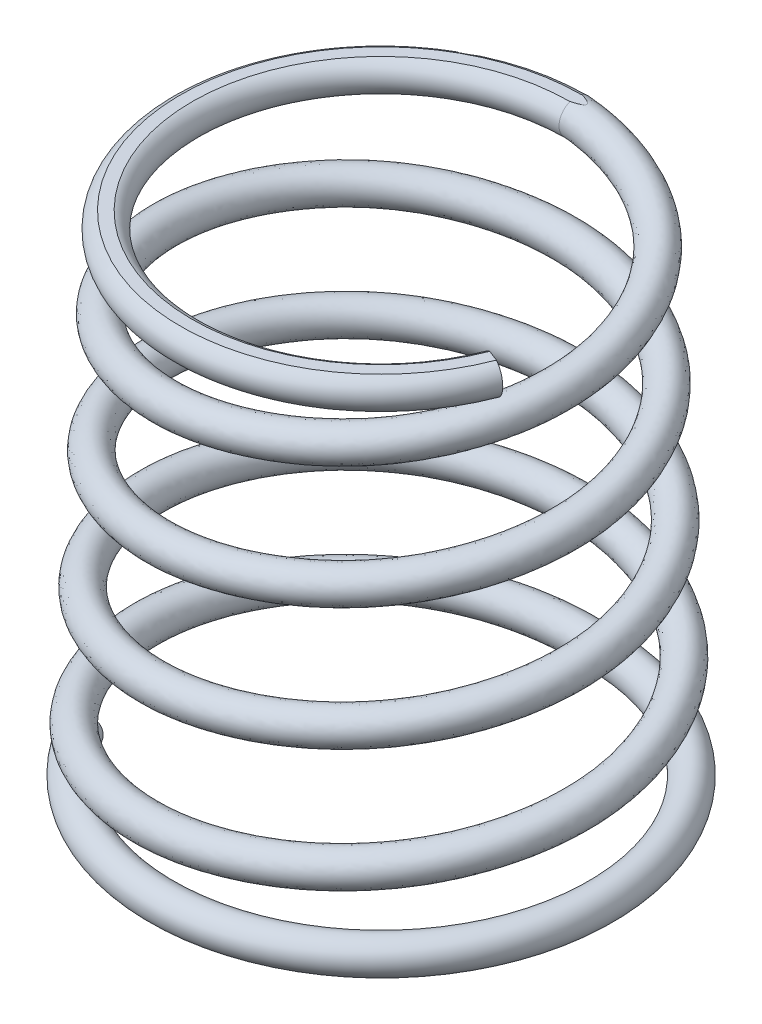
ISO-10303-21;
HEADER;
FILE_DESCRIPTION(('STEP AP214'),'2;1');
FILE_NAME('part.step','',(''),(''),'','','');
FILE_SCHEMA(('AUTOMOTIVE_DESIGN { 1 0 10303 214 1 1 1 1 }'));
ENDSEC;
DATA;
#1=APPLICATION_CONTEXT('core data for automotive mechanical design processes');
#2=APPLICATION_PROTOCOL_DEFINITION('international standard','automotive_design',2000,#1);
#3=PRODUCT_CONTEXT('',#1,'mechanical');
#4=PRODUCT('Part','Part','',(#3));
#5=PRODUCT_RELATED_PRODUCT_CATEGORY('part','',(#4));
#6=PRODUCT_DEFINITION_FORMATION('','',#4);
#7=PRODUCT_DEFINITION_CONTEXT('part definition',#1,'design');
#8=PRODUCT_DEFINITION('design','',#6,#7);
#9=PRODUCT_DEFINITION_SHAPE('','',#8);
#10=(LENGTH_UNIT() NAMED_UNIT(*) SI_UNIT(.MILLI.,.METRE.));
#11=(NAMED_UNIT(*) PLANE_ANGLE_UNIT() SI_UNIT($,.RADIAN.));
#12=(NAMED_UNIT(*) SI_UNIT($,.STERADIAN.) SOLID_ANGLE_UNIT());
#13=UNCERTAINTY_MEASURE_WITH_UNIT(LENGTH_MEASURE(1.E-05),#10,'distance_accuracy_value','');
#14=(GEOMETRIC_REPRESENTATION_CONTEXT(3) GLOBAL_UNCERTAINTY_ASSIGNED_CONTEXT((#13)) GLOBAL_UNIT_ASSIGNED_CONTEXT((#10,
#11,#12)) REPRESENTATION_CONTEXT('',''));
#15=CARTESIAN_POINT('',(0.,0.,0.));
#16=DIRECTION('',(0.,0.,1.));
#17=DIRECTION('',(1.,0.,0.));
#18=AXIS2_PLACEMENT_3D('',#15,#16,#17);
#19=CARTESIAN_POINT('',(-3.17002898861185E-13,14.,-5.76629109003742));
#20=DIRECTION('',(1.,0.,0.));
#21=DIRECTION('',(0.,0.,-1.));
#22=AXIS2_PLACEMENT_3D('',#19,#20,#21);
#23=PLANE('',#22);
#24=CARTESIAN_POINT('',(-3.21832305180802E-13,14.,-5.76102389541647));
#25=DIRECTION('',(-1.,0.,0.));
#26=DIRECTION('',(0.,0.,1.));
#27=AXIS2_PLACEMENT_3D('',#24,#25,#26);
#28=CIRCLE('',#27,0.500000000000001);
#29=CARTESIAN_POINT('',(-3.31547664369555E-13,14.4687800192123,-5.93493563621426));
#30=VERTEX_POINT('',#29);
#31=CARTESIAN_POINT('',(-3.16855776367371E-13,13.5000069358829,-5.76365749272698));
#32=VERTEX_POINT('',#31);
#33=EDGE_CURVE('E90',#30,#32,#28,.T.);
#34=ORIENTED_EDGE('',*,*,#33,.F.);
#35=DIRECTION('',(0.,0.,-1.));
#36=VECTOR('',#35,1.);
#37=CARTESIAN_POINT('',(-3.17002898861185E-13,14.4687800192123,-5.76629109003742));
#38=LINE('',#37,#36);
#39=CARTESIAN_POINT('',(-3.26718252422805E-13,14.4687800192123,-5.94020283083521));
#40=VERTEX_POINT('',#39);
#41=EDGE_CURVE('E95',#30,#40,#38,.T.);
#42=ORIENTED_EDGE('',*,*,#41,.T.);
#43=CARTESIAN_POINT('',(-3.17002898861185E-13,14.,-5.76629109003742));
#44=DIRECTION('',(1.,0.,0.));
#45=DIRECTION('',(0.,0.,-1.));
#46=AXIS2_PLACEMENT_3D('',#43,#44,#45);
#47=CIRCLE('',#46,0.500000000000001);
#48=CARTESIAN_POINT('',(-3.4493474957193E-13,14.,-6.26629109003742));
#49=VERTEX_POINT('',#48);
#50=EDGE_CURVE('E41',#49,#40,#47,.T.);
#51=ORIENTED_EDGE('',*,*,#50,.F.);
#52=EDGE_CURVE('E153',#32,#49,#47,.T.);
#53=ORIENTED_EDGE('',*,*,#52,.F.);
#54=EDGE_LOOP('',(#34,#42,#51,#53));
#55=FACE_BOUND('',#54,.T.);
#56=ADVANCED_FACE('F31',(#55),#23,.F.);
#57=CARTESIAN_POINT('',(0.,0.,-6.5));
#58=DIRECTION('',(1.,0.,0.));
#59=DIRECTION('',(0.,0.,-1.));
#60=AXIS2_PLACEMENT_3D('',#57,#58,#59);
#61=PLANE('',#60);
#62=CARTESIAN_POINT('',(0.,0.,-6.5));
#63=DIRECTION('',(1.,0.,0.));
#64=DIRECTION('',(0.,0.,-1.));
#65=AXIS2_PLACEMENT_3D('',#62,#63,#64);
#66=CIRCLE('',#65,0.500000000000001);
#67=CARTESIAN_POINT('',(0.,0.,-7.));
#68=VERTEX_POINT('',#67);
#69=CARTESIAN_POINT('',(0.,0.499993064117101,-6.49736640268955));
#70=VERTEX_POINT('',#69);
#71=EDGE_CURVE('E150',#68,#70,#66,.T.);
#72=ORIENTED_EDGE('',*,*,#71,.T.);
#73=CARTESIAN_POINT('',(0.,0.,-6.49473280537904));
#74=DIRECTION('',(1.,0.,0.));
#75=DIRECTION('',(0.,0.,-1.));
#76=AXIS2_PLACEMENT_3D('',#73,#74,#75);
#77=CIRCLE('',#76,0.500000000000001);
#78=CARTESIAN_POINT('',(0.,-0.4999930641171,-6.49736640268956));
#79=VERTEX_POINT('',#78);
#80=EDGE_CURVE('E89',#79,#70,#77,.T.);
#81=ORIENTED_EDGE('',*,*,#80,.F.);
#82=EDGE_CURVE('E147',#79,#68,#66,.T.);
#83=ORIENTED_EDGE('',*,*,#82,.T.);
#84=EDGE_LOOP('',(#72,#81,#83));
#85=FACE_BOUND('',#84,.T.);
#86=ADVANCED_FACE('F33',(#85),#61,.T.);
#87=CARTESIAN_POINT('',(0.,0.,-7.));
#88=CARTESIAN_POINT('',(-1.83259572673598,0.145833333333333,-6.99235719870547));
#89=CARTESIAN_POINT('',(-3.64734257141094,0.291666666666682,-6.23053525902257));
#90=CARTESIAN_POINT('',(-6.21972670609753,0.583333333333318,-3.63653401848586));
#91=CARTESIAN_POINT('',(-6.96178599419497,0.729166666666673,-1.82059042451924));
#92=CARTESIAN_POINT('',(-6.94650039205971,1.02083333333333,1.82059042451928));
#93=CARTESIAN_POINT('',(-6.1896205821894,1.16666666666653,3.62340593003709));
#94=CARTESIAN_POINT('',(-3.61259737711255,1.45833333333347,6.17881202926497));
#95=CARTESIAN_POINT('',(-1.80858514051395,1.60416666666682,6.9159291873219));
#96=CARTESIAN_POINT('',(1.80858514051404,1.89583333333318,6.90064358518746));
#97=CARTESIAN_POINT('',(3.5994692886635,2.04166666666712,6.14870590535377));
#98=CARTESIAN_POINT('',(6.13789735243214,2.33333333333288,3.58866073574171));
#99=CARTESIAN_POINT('',(6.87007238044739,2.47916666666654,1.79657985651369));
#100=CARTESIAN_POINT('',(6.85478677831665,2.77083333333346,-1.79657985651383));
#101=CARTESIAN_POINT('',(6.10779122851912,2.91666666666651,-3.57553264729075));
#102=CARTESIAN_POINT('',(3.56472409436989,3.20833333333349,-6.09698267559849));
#103=CARTESIAN_POINT('',(1.78457457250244,3.35416666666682,-6.82421557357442));
#104=CARTESIAN_POINT('',(-1.78457457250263,3.64583333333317,-6.80892997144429));
#105=CARTESIAN_POINT('',(-3.55159600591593,3.79166666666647,-6.0668765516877));
#106=CARTESIAN_POINT('',(-6.0560679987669,4.08333333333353,-3.54078745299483));
#107=CARTESIAN_POINT('',(-6.77835876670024,4.22916666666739,-1.77256928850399));
#108=CARTESIAN_POINT('',(-6.76307316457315,4.52083333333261,1.77256928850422));
#109=CARTESIAN_POINT('',(-6.02596187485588,4.6666666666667,3.52765936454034));
#110=CARTESIAN_POINT('',(-3.51685081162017,4.9583333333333,6.01515332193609));
#111=CARTESIAN_POINT('',(-1.76056400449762,5.10416666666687,6.73250195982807));
#112=CARTESIAN_POINT('',(1.7605640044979,5.39583333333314,6.71721635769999));
#113=CARTESIAN_POINT('',(3.50372272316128,5.54166666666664,5.98504719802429));
#114=CARTESIAN_POINT('',(5.97423864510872,5.83333333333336,3.4929141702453));
#115=CARTESIAN_POINT('',(6.68664515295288,5.97916666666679,1.74855872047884));
#116=CARTESIAN_POINT('',(6.67135955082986,6.27083333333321,-1.74855872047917));
#117=CARTESIAN_POINT('',(5.94413252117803,6.41666666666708,-3.4797860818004));
#118=CARTESIAN_POINT('',(3.46897752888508,6.70833333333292,-5.9333239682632));
#119=CARTESIAN_POINT('',(1.73655343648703,6.85416666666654,-6.64078834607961));
#120=CARTESIAN_POINT('',(-1.7365534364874,7.14583333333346,-6.62550274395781));
#121=CARTESIAN_POINT('',(-3.45584944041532,7.29166666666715,-5.90321784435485));
#122=CARTESIAN_POINT('',(-5.89240929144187,7.58333333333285,-3.4450408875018));
#123=CARTESIAN_POINT('',(-6.59493153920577,7.72916666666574,-1.72454815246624));
#124=CARTESIAN_POINT('',(-6.57964593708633,8.02083333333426,1.72454815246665));
#125=CARTESIAN_POINT('',(-5.86230316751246,8.16666666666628,3.43191279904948));
#126=CARTESIAN_POINT('',(-3.4211042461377,8.45833333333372,5.85149461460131));
#127=CARTESIAN_POINT('',(-1.71254286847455,8.60416666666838,6.54907473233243));
#128=CARTESIAN_POINT('',(1.712542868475,8.89583333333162,6.53378913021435));
#129=CARTESIAN_POINT('',(3.40797615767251,9.04166666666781,5.82138849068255));
#130=CARTESIAN_POINT('',(5.81057993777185,9.33333333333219,3.39716760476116));
#131=CARTESIAN_POINT('',(6.50321792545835,9.47916666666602,1.70053758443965));
#132=CARTESIAN_POINT('',(6.48793232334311,9.77083333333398,-1.70053758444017));
#133=CARTESIAN_POINT('',(5.78047381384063,9.9166666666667,-3.38403951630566));
#134=CARTESIAN_POINT('',(3.37323096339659,10.2083333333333,-5.7696652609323));
#135=CARTESIAN_POINT('',(1.68853230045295,10.3541666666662,-6.45736111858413));
#136=CARTESIAN_POINT('',(-1.68853230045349,10.6458333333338,-6.44207551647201));
#137=CARTESIAN_POINT('',(-3.36010287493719,10.791666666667,-5.73955913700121));
#138=CARTESIAN_POINT('',(-5.72875058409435,11.083333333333,-3.34929432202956));
#139=CARTESIAN_POINT('',(-6.41150431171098,11.2291666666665,-1.67652701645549));
#140=CARTESIAN_POINT('',(-6.39621870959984,11.5208333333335,1.67652701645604));
#141=CARTESIAN_POINT('',(-5.69864446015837,11.6666666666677,3.33616623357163));
#142=CARTESIAN_POINT('',(-3.32535768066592,11.9583333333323,5.68783590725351));
#143=CARTESIAN_POINT('',(-1.66452173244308,12.104166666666,6.36564750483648));
#144=CARTESIAN_POINT('',(1.66452173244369,12.395833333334,6.350361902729));
#145=CARTESIAN_POINT('',(3.31222959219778,12.5416666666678,5.65772978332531));
#146=CARTESIAN_POINT('',(5.64692123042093,12.8333333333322,3.30142103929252));
#147=CARTESIAN_POINT('',(6.3197906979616,12.9791666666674,1.65251644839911));
#148=CARTESIAN_POINT('',(6.30450509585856,13.2708333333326,-1.65251644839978));
#149=CARTESIAN_POINT('',(5.61681510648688,13.4166666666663,-3.28829295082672));
#150=CARTESIAN_POINT('',(3.27748439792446,13.7083333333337,-5.60600655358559));
#151=CARTESIAN_POINT('',(1.64051118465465,13.854166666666,-6.27393389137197));
#152=CARTESIAN_POINT('',(-3.4493474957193E-13,14.,-6.26629109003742));
#153=CARTESIAN_POINT('',(0.,1.,-7.));
#154=CARTESIAN_POINT('',(-1.83259572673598,1.14583333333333,-6.99235719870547));
#155=CARTESIAN_POINT('',(-3.64734257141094,1.29166666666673,-6.23053525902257));
#156=CARTESIAN_POINT('',(-6.21972670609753,1.58333333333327,-3.63653401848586));
#157=CARTESIAN_POINT('',(-6.96178599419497,1.72916666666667,-1.82059042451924));
#158=CARTESIAN_POINT('',(-6.94650039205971,2.02083333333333,1.82059042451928));
#159=CARTESIAN_POINT('',(-6.1896205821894,2.16666666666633,3.62340593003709));
#160=CARTESIAN_POINT('',(-3.61259737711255,2.45833333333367,6.17881202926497));
#161=CARTESIAN_POINT('',(-1.80858514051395,2.60416666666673,6.9159291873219));
#162=CARTESIAN_POINT('',(1.80858514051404,2.89583333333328,6.90064358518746));
#163=CARTESIAN_POINT('',(3.5994692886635,3.04166666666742,6.14870590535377));
#164=CARTESIAN_POINT('',(6.13789735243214,3.33333333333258,3.58866073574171));
#165=CARTESIAN_POINT('',(6.87007238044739,3.47916666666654,1.79657985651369));
#166=CARTESIAN_POINT('',(6.85478677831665,3.77083333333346,-1.79657985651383));
#167=CARTESIAN_POINT('',(6.10779122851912,3.91666666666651,-3.57553264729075));
#168=CARTESIAN_POINT('',(3.56472409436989,4.20833333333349,-6.09698267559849));
#169=CARTESIAN_POINT('',(1.78457457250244,4.35416666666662,-6.82421557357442));
#170=CARTESIAN_POINT('',(-1.78457457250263,4.64583333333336,-6.80892997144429));
#171=CARTESIAN_POINT('',(-3.55159600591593,4.79166666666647,-6.0668765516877));
#172=CARTESIAN_POINT('',(-6.0560679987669,5.08333333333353,-3.54078745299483));
#173=CARTESIAN_POINT('',(-6.77835876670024,5.22916666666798,-1.77256928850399));
#174=CARTESIAN_POINT('',(-6.76307316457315,5.52083333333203,1.77256928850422));
#175=CARTESIAN_POINT('',(-6.02596187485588,5.66666666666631,3.52765936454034));
#176=CARTESIAN_POINT('',(-3.51685081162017,5.95833333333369,6.01515332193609));
#177=CARTESIAN_POINT('',(-1.76056400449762,6.10416666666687,6.73250195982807));
#178=CARTESIAN_POINT('',(1.7605640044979,6.39583333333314,6.71721635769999));
#179=CARTESIAN_POINT('',(3.50372272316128,6.54166666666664,5.98504719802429));
#180=CARTESIAN_POINT('',(5.97423864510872,6.83333333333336,3.4929141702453));
#181=CARTESIAN_POINT('',(6.68664515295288,6.97916666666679,1.74855872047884));
#182=CARTESIAN_POINT('',(6.67135955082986,7.27083333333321,-1.74855872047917));
#183=CARTESIAN_POINT('',(5.94413252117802,7.41666666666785,-3.4797860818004));
#184=CARTESIAN_POINT('',(3.46897752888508,7.70833333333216,-5.9333239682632));
#185=CARTESIAN_POINT('',(1.73655343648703,7.85416666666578,-6.64078834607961));
#186=CARTESIAN_POINT('',(-1.7365534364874,8.14583333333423,-6.62550274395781));
#187=CARTESIAN_POINT('',(-3.45584944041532,8.29166666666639,-5.90321784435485));
#188=CARTESIAN_POINT('',(-5.89240929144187,8.58333333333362,-3.4450408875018));
#189=CARTESIAN_POINT('',(-6.59493153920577,8.72916666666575,-1.72454815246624));
#190=CARTESIAN_POINT('',(-6.57964593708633,9.02083333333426,1.72454815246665));
#191=CARTESIAN_POINT('',(-5.86230316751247,9.16666666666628,3.43191279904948));
#192=CARTESIAN_POINT('',(-3.4211042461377,9.45833333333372,5.85149461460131));
#193=CARTESIAN_POINT('',(-1.71254286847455,9.60416666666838,6.54907473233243));
#194=CARTESIAN_POINT('',(1.712542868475,9.89583333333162,6.53378913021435));
#195=CARTESIAN_POINT('',(3.40797615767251,10.0416666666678,5.82138849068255));
#196=CARTESIAN_POINT('',(5.81057993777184,10.3333333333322,3.39716760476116));
#197=CARTESIAN_POINT('',(6.50321792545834,10.479166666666,1.70053758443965));
#198=CARTESIAN_POINT('',(6.48793232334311,10.770833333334,-1.70053758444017));
#199=CARTESIAN_POINT('',(5.78047381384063,10.9166666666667,-3.38403951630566));
#200=CARTESIAN_POINT('',(3.37323096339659,11.2083333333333,-5.7696652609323));
#201=CARTESIAN_POINT('',(1.68853230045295,11.3541666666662,-6.45736111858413));
#202=CARTESIAN_POINT('',(-1.68853230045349,11.6458333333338,-6.44207551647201));
#203=CARTESIAN_POINT('',(-3.36010287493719,11.791666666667,-5.73955913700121));
#204=CARTESIAN_POINT('',(-5.72875058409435,12.083333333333,-3.34929432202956));
#205=CARTESIAN_POINT('',(-6.41150431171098,12.2291666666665,-1.67652701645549));
#206=CARTESIAN_POINT('',(-6.39621870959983,12.5208333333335,1.67652701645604));
#207=CARTESIAN_POINT('',(-5.69864446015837,12.6666666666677,3.33616623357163));
#208=CARTESIAN_POINT('',(-3.32535768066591,12.9583333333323,5.68783590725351));
#209=CARTESIAN_POINT('',(-1.66452173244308,13.104166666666,6.36564750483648));
#210=CARTESIAN_POINT('',(1.66452173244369,13.395833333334,6.350361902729));
#211=CARTESIAN_POINT('',(3.31222959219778,13.5416666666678,5.65772978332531));
#212=CARTESIAN_POINT('',(5.64692123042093,13.8333333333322,3.30142103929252));
#213=CARTESIAN_POINT('',(6.3197906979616,13.9791666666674,1.65251644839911));
#214=CARTESIAN_POINT('',(6.30450509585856,14.2708333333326,-1.65251644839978));
#215=CARTESIAN_POINT('',(5.61681510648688,14.4166666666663,-3.28829295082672));
#216=CARTESIAN_POINT('',(3.27748439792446,14.7083333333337,-5.60600655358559));
#217=CARTESIAN_POINT('',(1.64051118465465,14.854166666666,-6.27393389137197));
#218=CARTESIAN_POINT('',(-3.4493474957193E-13,15.,-6.26629109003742));
#219=CARTESIAN_POINT('',(0.,1.,-6.));
#220=CARTESIAN_POINT('',(-1.57079633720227,1.14583333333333,-5.99235719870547));
#221=CARTESIAN_POINT('',(-3.12535591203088,1.29166666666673,-5.33830835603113));
#222=CARTESIAN_POINT('',(-5.32749980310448,1.58333333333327,-3.1145473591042));
#223=CARTESIAN_POINT('',(-5.96178599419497,1.72916666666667,-1.55879103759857));
#224=CARTESIAN_POINT('',(-5.94650039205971,2.02083333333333,1.55879103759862));
#225=CARTESIAN_POINT('',(-5.29739367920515,2.16666666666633,3.10141927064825));
#226=CARTESIAN_POINT('',(-3.09061071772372,2.45833333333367,5.2865851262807));
#227=CARTESIAN_POINT('',(-1.54678575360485,2.60416666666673,5.9159291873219));
#228=CARTESIAN_POINT('',(1.54678575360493,2.89583333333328,5.90064358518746));
#229=CARTESIAN_POINT('',(3.07748262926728,3.04166666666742,5.25647900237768));
#230=CARTESIAN_POINT('',(5.24567044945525,3.33333333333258,3.06667407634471));
#231=CARTESIAN_POINT('',(5.87007238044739,3.47916666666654,1.53478046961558));
#232=CARTESIAN_POINT('',(5.85478677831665,3.77083333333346,-1.5347804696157));
#233=CARTESIAN_POINT('',(5.21556432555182,3.91666666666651,-3.05354598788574));
#234=CARTESIAN_POINT('',(3.0427374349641,4.20833333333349,-5.20475577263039));
#235=CARTESIAN_POINT('',(1.52277518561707,4.35416666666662,-5.82421557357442));
#236=CARTESIAN_POINT('',(-1.52277518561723,4.64583333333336,-5.80892997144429));
#237=CARTESIAN_POINT('',(-3.02960934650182,4.79166666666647,-5.17464964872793));
#238=CARTESIAN_POINT('',(-5.1638410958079,5.08333333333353,-3.01880079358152));
#239=CARTESIAN_POINT('',(-5.77835876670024,5.22916666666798,-1.51076990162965));
#240=CARTESIAN_POINT('',(-5.76307316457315,5.52083333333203,1.51076990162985));
#241=CARTESIAN_POINT('',(-5.13373497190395,5.66666666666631,3.0056727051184));
#242=CARTESIAN_POINT('',(-2.99486415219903,5.95833333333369,5.12292641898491));
#243=CARTESIAN_POINT('',(-1.49876461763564,6.10416666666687,5.73250195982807));
#244=CARTESIAN_POINT('',(1.49876461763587,6.39583333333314,5.71721635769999));
#245=CARTESIAN_POINT('',(2.98173606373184,6.54166666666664,5.09282029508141));
#246=CARTESIAN_POINT('',(5.08201174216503,6.83333333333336,2.97092751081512));
#247=CARTESIAN_POINT('',(5.68664515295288,6.97916666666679,1.48675933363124));
#248=CARTESIAN_POINT('',(5.67135955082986,7.27083333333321,-1.48675933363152));
#249=CARTESIAN_POINT('',(5.05190561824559,7.41666666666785,-2.95779942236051));
#250=CARTESIAN_POINT('',(2.94699086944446,7.70833333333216,-5.04109706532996));
#251=CARTESIAN_POINT('',(1.47475404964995,7.85416666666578,-5.64078834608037));
#252=CARTESIAN_POINT('',(-1.47475404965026,8.14583333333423,-5.62550274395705));
#253=CARTESIAN_POINT('',(-2.93386278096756,8.29166666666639,-5.01099094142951));
#254=CARTESIAN_POINT('',(-5.00018238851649,8.58333333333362,-2.92305422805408));
#255=CARTESIAN_POINT('',(-5.59493153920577,8.72916666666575,-1.46274876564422));
#256=CARTESIAN_POINT('',(-5.57964593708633,9.02083333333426,1.46274876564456));
#257=CARTESIAN_POINT('',(-4.9700762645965,9.16666666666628,2.9099261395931));
#258=CARTESIAN_POINT('',(-2.89911758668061,9.45833333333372,4.95926771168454));
#259=CARTESIAN_POINT('',(-1.45074348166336,9.60416666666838,5.54907473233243));
#260=CARTESIAN_POINT('',(1.45074348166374,9.89583333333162,5.53378913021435));
#261=CARTESIAN_POINT('',(2.88598949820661,10.0416666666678,4.92916158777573));
#262=CARTESIAN_POINT('',(4.9183530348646,10.3333333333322,2.87518094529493));
#263=CARTESIAN_POINT('',(5.50321792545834,10.479166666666,1.43873819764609));
#264=CARTESIAN_POINT('',(5.48793232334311,10.770833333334,-1.43873819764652));
#265=CARTESIAN_POINT('',(4.88824691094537,10.9166666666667,-2.86205285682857));
#266=CARTESIAN_POINT('',(2.85124430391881,11.2083333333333,-4.87743835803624));
#267=CARTESIAN_POINT('',(1.42673291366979,11.3541666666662,-5.45736111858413));
#268=CARTESIAN_POINT('',(-1.42673291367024,11.6458333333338,-5.44207551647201));
#269=CARTESIAN_POINT('',(-2.83811621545,11.791666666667,-4.84733223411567));
#270=CARTESIAN_POINT('',(-4.83652368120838,12.083333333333,-2.82730766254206));
#271=CARTESIAN_POINT('',(-5.41150431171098,12.2291666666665,-1.41472762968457));
#272=CARTESIAN_POINT('',(-5.39621870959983,12.5208333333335,1.41472762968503));
#273=CARTESIAN_POINT('',(-4.80641755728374,12.6666666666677,2.81417957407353));
#274=CARTESIAN_POINT('',(-2.80337102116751,12.9583333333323,4.79560900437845));
#275=CARTESIAN_POINT('',(-1.40272234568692,13.104166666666,5.36564750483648));
#276=CARTESIAN_POINT('',(1.40272234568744,13.395833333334,5.350361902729));
#277=CARTESIAN_POINT('',(2.79024293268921,13.5416666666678,4.76550288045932));
#278=CARTESIAN_POINT('',(4.75469432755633,13.8333333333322,2.77943437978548));
#279=CARTESIAN_POINT('',(5.31979069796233,13.9791666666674,1.39071706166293));
#280=CARTESIAN_POINT('',(5.30450509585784,14.2708333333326,-1.3907170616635));
#281=CARTESIAN_POINT('',(4.72458820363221,14.4166666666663,-2.76630629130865));
#282=CARTESIAN_POINT('',(2.75549773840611,14.7083333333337,-4.71377965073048));
#283=CARTESIAN_POINT('',(1.37871179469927,14.854166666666,-5.27393389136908));
#284=CARTESIAN_POINT('',(-2.8907104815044E-13,15.,-5.26629109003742));
#285=CARTESIAN_POINT('',(0.,0.,-6.));
#286=CARTESIAN_POINT('',(-1.57079633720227,0.145833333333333,-5.99235719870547));
#287=CARTESIAN_POINT('',(-3.12535591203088,0.291666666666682,-5.33830835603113));
#288=CARTESIAN_POINT('',(-5.32749980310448,0.583333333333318,-3.1145473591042));
#289=CARTESIAN_POINT('',(-5.96178599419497,0.729166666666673,-1.55879103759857));
#290=CARTESIAN_POINT('',(-5.94650039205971,1.02083333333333,1.55879103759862));
#291=CARTESIAN_POINT('',(-5.29739367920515,1.16666666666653,3.10141927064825));
#292=CARTESIAN_POINT('',(-3.09061071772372,1.45833333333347,5.2865851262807));
#293=CARTESIAN_POINT('',(-1.54678575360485,1.60416666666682,5.9159291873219));
#294=CARTESIAN_POINT('',(1.54678575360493,1.89583333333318,5.90064358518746));
#295=CARTESIAN_POINT('',(3.07748262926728,2.04166666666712,5.25647900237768));
#296=CARTESIAN_POINT('',(5.24567044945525,2.33333333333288,3.06667407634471));
#297=CARTESIAN_POINT('',(5.87007238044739,2.47916666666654,1.53478046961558));
#298=CARTESIAN_POINT('',(5.85478677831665,2.77083333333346,-1.5347804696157));
#299=CARTESIAN_POINT('',(5.21556432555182,2.91666666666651,-3.05354598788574));
#300=CARTESIAN_POINT('',(3.0427374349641,3.20833333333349,-5.20475577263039));
#301=CARTESIAN_POINT('',(1.52277518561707,3.35416666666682,-5.82421557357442));
#302=CARTESIAN_POINT('',(-1.52277518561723,3.64583333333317,-5.80892997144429));
#303=CARTESIAN_POINT('',(-3.02960934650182,3.79166666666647,-5.17464964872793));
#304=CARTESIAN_POINT('',(-5.1638410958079,4.08333333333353,-3.01880079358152));
#305=CARTESIAN_POINT('',(-5.77835876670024,4.22916666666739,-1.51076990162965));
#306=CARTESIAN_POINT('',(-5.76307316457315,4.52083333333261,1.51076990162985));
#307=CARTESIAN_POINT('',(-5.13373497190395,4.6666666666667,3.0056727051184));
#308=CARTESIAN_POINT('',(-2.99486415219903,4.9583333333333,5.12292641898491));
#309=CARTESIAN_POINT('',(-1.49876461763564,5.10416666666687,5.73250195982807));
#310=CARTESIAN_POINT('',(1.49876461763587,5.39583333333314,5.71721635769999));
#311=CARTESIAN_POINT('',(2.98173606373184,5.54166666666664,5.09282029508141));
#312=CARTESIAN_POINT('',(5.08201174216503,5.83333333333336,2.97092751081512));
#313=CARTESIAN_POINT('',(5.68664515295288,5.97916666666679,1.48675933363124));
#314=CARTESIAN_POINT('',(5.67135955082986,6.27083333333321,-1.48675933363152));
#315=CARTESIAN_POINT('',(5.05190561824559,6.41666666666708,-2.95779942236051));
#316=CARTESIAN_POINT('',(2.94699086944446,6.70833333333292,-5.04109706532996));
#317=CARTESIAN_POINT('',(1.47475404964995,6.85416666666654,-5.64078834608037));
#318=CARTESIAN_POINT('',(-1.47475404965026,7.14583333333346,-5.62550274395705));
#319=CARTESIAN_POINT('',(-2.93386278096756,7.29166666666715,-5.01099094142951));
#320=CARTESIAN_POINT('',(-5.00018238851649,7.58333333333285,-2.92305422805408));
#321=CARTESIAN_POINT('',(-5.59493153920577,7.72916666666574,-1.46274876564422));
#322=CARTESIAN_POINT('',(-5.57964593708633,8.02083333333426,1.46274876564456));
#323=CARTESIAN_POINT('',(-4.9700762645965,8.16666666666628,2.9099261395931));
#324=CARTESIAN_POINT('',(-2.89911758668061,8.45833333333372,4.95926771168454));
#325=CARTESIAN_POINT('',(-1.45074348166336,8.60416666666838,5.54907473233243));
#326=CARTESIAN_POINT('',(1.45074348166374,8.89583333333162,5.53378913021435));
#327=CARTESIAN_POINT('',(2.88598949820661,9.04166666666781,4.92916158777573));
#328=CARTESIAN_POINT('',(4.9183530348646,9.33333333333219,2.87518094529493));
#329=CARTESIAN_POINT('',(5.50321792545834,9.47916666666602,1.43873819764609));
#330=CARTESIAN_POINT('',(5.48793232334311,9.77083333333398,-1.43873819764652));
#331=CARTESIAN_POINT('',(4.88824691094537,9.9166666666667,-2.86205285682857));
#332=CARTESIAN_POINT('',(2.85124430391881,10.2083333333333,-4.87743835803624));
#333=CARTESIAN_POINT('',(1.42673291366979,10.3541666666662,-5.45736111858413));
#334=CARTESIAN_POINT('',(-1.42673291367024,10.6458333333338,-5.44207551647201));
#335=CARTESIAN_POINT('',(-2.83811621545,10.791666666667,-4.84733223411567));
#336=CARTESIAN_POINT('',(-4.83652368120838,11.083333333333,-2.82730766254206));
#337=CARTESIAN_POINT('',(-5.41150431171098,11.2291666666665,-1.41472762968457));
#338=CARTESIAN_POINT('',(-5.39621870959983,11.5208333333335,1.41472762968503));
#339=CARTESIAN_POINT('',(-4.80641755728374,11.6666666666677,2.81417957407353));
#340=CARTESIAN_POINT('',(-2.80337102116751,11.9583333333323,4.79560900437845));
#341=CARTESIAN_POINT('',(-1.40272234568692,12.104166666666,5.36564750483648));
#342=CARTESIAN_POINT('',(1.40272234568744,12.395833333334,5.350361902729));
#343=CARTESIAN_POINT('',(2.79024293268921,12.5416666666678,4.76550288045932));
#344=CARTESIAN_POINT('',(4.75469432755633,12.8333333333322,2.77943437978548));
#345=CARTESIAN_POINT('',(5.31979069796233,12.9791666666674,1.39071706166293));
#346=CARTESIAN_POINT('',(5.30450509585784,13.2708333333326,-1.3907170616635));
#347=CARTESIAN_POINT('',(4.72458820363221,13.4166666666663,-2.76630629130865));
#348=CARTESIAN_POINT('',(2.75549773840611,13.7083333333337,-4.71377965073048));
#349=CARTESIAN_POINT('',(1.37871179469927,13.854166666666,-5.27393389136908));
#350=CARTESIAN_POINT('',(-2.8907104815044E-13,14.,-5.26629109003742));
#351=CARTESIAN_POINT('',(0.,-1.,-6.));
#352=CARTESIAN_POINT('',(-1.57079633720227,-0.854166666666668,-5.99235719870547));
#353=CARTESIAN_POINT('',(-3.12535591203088,-0.70833333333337,-5.33830835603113));
#354=CARTESIAN_POINT('',(-5.32749980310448,-0.416666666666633,-3.1145473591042));
#355=CARTESIAN_POINT('',(-5.96178599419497,-0.270833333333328,-1.55879103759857));
#356=CARTESIAN_POINT('',(-5.94650039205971,0.0208333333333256,1.55879103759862));
#357=CARTESIAN_POINT('',(-5.29739367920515,0.166666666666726,3.10141927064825));
#358=CARTESIAN_POINT('',(-3.09061071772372,0.458333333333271,5.2865851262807));
#359=CARTESIAN_POINT('',(-1.54678575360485,0.604166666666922,5.9159291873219));
#360=CARTESIAN_POINT('',(1.54678575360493,0.895833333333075,5.90064358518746));
#361=CARTESIAN_POINT('',(3.07748262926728,1.04166666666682,5.25647900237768));
#362=CARTESIAN_POINT('',(5.24567044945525,1.33333333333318,3.06667407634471));
#363=CARTESIAN_POINT('',(5.87007238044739,1.47916666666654,1.53478046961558));
#364=CARTESIAN_POINT('',(5.85478677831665,1.77083333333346,-1.5347804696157));
#365=CARTESIAN_POINT('',(5.21556432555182,1.91666666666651,-3.05354598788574));
#366=CARTESIAN_POINT('',(3.0427374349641,2.20833333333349,-5.20475577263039));
#367=CARTESIAN_POINT('',(1.52277518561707,2.35416666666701,-5.82421557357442));
#368=CARTESIAN_POINT('',(-1.52277518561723,2.64583333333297,-5.80892997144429));
#369=CARTESIAN_POINT('',(-3.02960934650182,2.79166666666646,-5.17464964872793));
#370=CARTESIAN_POINT('',(-5.1638410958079,3.08333333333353,-3.01880079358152));
#371=CARTESIAN_POINT('',(-5.77835876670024,3.22916666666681,-1.51076990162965));
#372=CARTESIAN_POINT('',(-5.76307316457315,3.52083333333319,1.51076990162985));
#373=CARTESIAN_POINT('',(-5.13373497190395,3.66666666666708,3.0056727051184));
#374=CARTESIAN_POINT('',(-2.99486415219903,3.95833333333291,5.12292641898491));
#375=CARTESIAN_POINT('',(-1.49876461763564,4.10416666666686,5.73250195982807));
#376=CARTESIAN_POINT('',(1.49876461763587,4.39583333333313,5.71721635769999));
#377=CARTESIAN_POINT('',(2.98173606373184,4.54166666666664,5.09282029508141));
#378=CARTESIAN_POINT('',(5.08201174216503,4.83333333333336,2.97092751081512));
#379=CARTESIAN_POINT('',(5.68664515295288,4.97916666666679,1.48675933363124));
#380=CARTESIAN_POINT('',(5.67135955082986,5.27083333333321,-1.48675933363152));
#381=CARTESIAN_POINT('',(5.05190561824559,5.41666666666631,-2.95779942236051));
#382=CARTESIAN_POINT('',(2.94699086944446,5.70833333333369,-5.04109706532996));
#383=CARTESIAN_POINT('',(1.47475404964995,5.8541666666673,-5.64078834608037));
#384=CARTESIAN_POINT('',(-1.47475404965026,6.1458333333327,-5.62550274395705));
#385=CARTESIAN_POINT('',(-2.93386278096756,6.29166666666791,-5.01099094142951));
#386=CARTESIAN_POINT('',(-5.00018238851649,6.58333333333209,-2.92305422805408));
#387=CARTESIAN_POINT('',(-5.59493153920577,6.72916666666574,-1.46274876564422));
#388=CARTESIAN_POINT('',(-5.57964593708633,7.02083333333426,1.46274876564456));
#389=CARTESIAN_POINT('',(-4.9700762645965,7.16666666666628,2.9099261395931));
#390=CARTESIAN_POINT('',(-2.89911758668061,7.45833333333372,4.95926771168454));
#391=CARTESIAN_POINT('',(-1.45074348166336,7.60416666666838,5.54907473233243));
#392=CARTESIAN_POINT('',(1.45074348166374,7.89583333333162,5.53378913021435));
#393=CARTESIAN_POINT('',(2.88598949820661,8.0416666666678,4.92916158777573));
#394=CARTESIAN_POINT('',(4.9183530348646,8.33333333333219,2.87518094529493));
#395=CARTESIAN_POINT('',(5.50321792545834,8.47916666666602,1.43873819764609));
#396=CARTESIAN_POINT('',(5.48793232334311,8.77083333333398,-1.43873819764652));
#397=CARTESIAN_POINT('',(4.88824691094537,8.9166666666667,-2.86205285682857));
#398=CARTESIAN_POINT('',(2.85124430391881,9.2083333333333,-4.87743835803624));
#399=CARTESIAN_POINT('',(1.42673291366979,9.35416666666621,-5.45736111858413));
#400=CARTESIAN_POINT('',(-1.42673291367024,9.6458333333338,-5.44207551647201));
#401=CARTESIAN_POINT('',(-2.83811621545,9.79166666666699,-4.84733223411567));
#402=CARTESIAN_POINT('',(-4.83652368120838,10.083333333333,-2.82730766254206));
#403=CARTESIAN_POINT('',(-5.41150431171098,10.2291666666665,-1.41472762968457));
#404=CARTESIAN_POINT('',(-5.39621870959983,10.5208333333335,1.41472762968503));
#405=CARTESIAN_POINT('',(-4.80641755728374,10.6666666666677,2.81417957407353));
#406=CARTESIAN_POINT('',(-2.80337102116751,10.9583333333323,4.79560900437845));
#407=CARTESIAN_POINT('',(-1.40272234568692,11.104166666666,5.36564750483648));
#408=CARTESIAN_POINT('',(1.40272234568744,11.395833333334,5.350361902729));
#409=CARTESIAN_POINT('',(2.79024293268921,11.5416666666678,4.76550288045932));
#410=CARTESIAN_POINT('',(4.75469432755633,11.8333333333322,2.77943437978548));
#411=CARTESIAN_POINT('',(5.31979069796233,11.9791666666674,1.39071706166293));
#412=CARTESIAN_POINT('',(5.30450509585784,12.2708333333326,-1.3907170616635));
#413=CARTESIAN_POINT('',(4.72458820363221,12.4166666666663,-2.76630629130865));
#414=CARTESIAN_POINT('',(2.75549773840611,12.7083333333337,-4.71377965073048));
#415=CARTESIAN_POINT('',(1.37871179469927,12.854166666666,-5.27393389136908));
#416=CARTESIAN_POINT('',(-2.8907104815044E-13,13.,-5.26629109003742));
#417=CARTESIAN_POINT('',(0.,-1.,-7.));
#418=CARTESIAN_POINT('',(-1.83259572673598,-0.854166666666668,-6.99235719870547));
#419=CARTESIAN_POINT('',(-3.64734257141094,-0.70833333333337,-6.23053525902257));
#420=CARTESIAN_POINT('',(-6.21972670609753,-0.416666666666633,-3.63653401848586));
#421=CARTESIAN_POINT('',(-6.96178599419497,-0.270833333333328,-1.82059042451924));
#422=CARTESIAN_POINT('',(-6.94650039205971,0.0208333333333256,1.82059042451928));
#423=CARTESIAN_POINT('',(-6.1896205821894,0.166666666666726,3.62340593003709));
#424=CARTESIAN_POINT('',(-3.61259737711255,0.458333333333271,6.17881202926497));
#425=CARTESIAN_POINT('',(-1.80858514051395,0.604166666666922,6.9159291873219));
#426=CARTESIAN_POINT('',(1.80858514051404,0.895833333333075,6.90064358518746));
#427=CARTESIAN_POINT('',(3.5994692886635,1.04166666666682,6.14870590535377));
#428=CARTESIAN_POINT('',(6.13789735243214,1.33333333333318,3.58866073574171));
#429=CARTESIAN_POINT('',(6.87007238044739,1.47916666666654,1.79657985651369));
#430=CARTESIAN_POINT('',(6.85478677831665,1.77083333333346,-1.79657985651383));
#431=CARTESIAN_POINT('',(6.10779122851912,1.91666666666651,-3.57553264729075));
#432=CARTESIAN_POINT('',(3.56472409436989,2.20833333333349,-6.09698267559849));
#433=CARTESIAN_POINT('',(1.78457457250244,2.35416666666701,-6.82421557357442));
#434=CARTESIAN_POINT('',(-1.78457457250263,2.64583333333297,-6.80892997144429));
#435=CARTESIAN_POINT('',(-3.55159600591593,2.79166666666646,-6.0668765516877));
#436=CARTESIAN_POINT('',(-6.0560679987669,3.08333333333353,-3.54078745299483));
#437=CARTESIAN_POINT('',(-6.77835876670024,3.22916666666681,-1.77256928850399));
#438=CARTESIAN_POINT('',(-6.76307316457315,3.52083333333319,1.77256928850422));
#439=CARTESIAN_POINT('',(-6.02596187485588,3.66666666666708,3.52765936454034));
#440=CARTESIAN_POINT('',(-3.51685081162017,3.95833333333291,6.01515332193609));
#441=CARTESIAN_POINT('',(-1.76056400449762,4.10416666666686,6.73250195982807));
#442=CARTESIAN_POINT('',(1.7605640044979,4.39583333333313,6.71721635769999));
#443=CARTESIAN_POINT('',(3.50372272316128,4.54166666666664,5.98504719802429));
#444=CARTESIAN_POINT('',(5.97423864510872,4.83333333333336,3.4929141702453));
#445=CARTESIAN_POINT('',(6.68664515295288,4.97916666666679,1.74855872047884));
#446=CARTESIAN_POINT('',(6.67135955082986,5.27083333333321,-1.74855872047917));
#447=CARTESIAN_POINT('',(5.94413252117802,5.41666666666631,-3.4797860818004));
#448=CARTESIAN_POINT('',(3.46897752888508,5.70833333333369,-5.9333239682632));
#449=CARTESIAN_POINT('',(1.73655343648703,5.8541666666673,-6.64078834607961));
#450=CARTESIAN_POINT('',(-1.7365534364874,6.1458333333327,-6.62550274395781));
#451=CARTESIAN_POINT('',(-3.45584944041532,6.29166666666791,-5.90321784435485));
#452=CARTESIAN_POINT('',(-5.89240929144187,6.58333333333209,-3.4450408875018));
#453=CARTESIAN_POINT('',(-6.59493153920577,6.72916666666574,-1.72454815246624));
#454=CARTESIAN_POINT('',(-6.57964593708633,7.02083333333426,1.72454815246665));
#455=CARTESIAN_POINT('',(-5.86230316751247,7.16666666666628,3.43191279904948));
#456=CARTESIAN_POINT('',(-3.4211042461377,7.45833333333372,5.85149461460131));
#457=CARTESIAN_POINT('',(-1.71254286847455,7.60416666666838,6.54907473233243));
#458=CARTESIAN_POINT('',(1.712542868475,7.89583333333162,6.53378913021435));
#459=CARTESIAN_POINT('',(3.40797615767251,8.0416666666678,5.82138849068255));
#460=CARTESIAN_POINT('',(5.81057993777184,8.33333333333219,3.39716760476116));
#461=CARTESIAN_POINT('',(6.50321792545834,8.47916666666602,1.70053758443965));
#462=CARTESIAN_POINT('',(6.48793232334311,8.77083333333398,-1.70053758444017));
#463=CARTESIAN_POINT('',(5.78047381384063,8.9166666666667,-3.38403951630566));
#464=CARTESIAN_POINT('',(3.37323096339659,9.2083333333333,-5.7696652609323));
#465=CARTESIAN_POINT('',(1.68853230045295,9.35416666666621,-6.45736111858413));
#466=CARTESIAN_POINT('',(-1.68853230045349,9.6458333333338,-6.44207551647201));
#467=CARTESIAN_POINT('',(-3.36010287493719,9.79166666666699,-5.73955913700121));
#468=CARTESIAN_POINT('',(-5.72875058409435,10.083333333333,-3.34929432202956));
#469=CARTESIAN_POINT('',(-6.41150431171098,10.2291666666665,-1.67652701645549));
#470=CARTESIAN_POINT('',(-6.39621870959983,10.5208333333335,1.67652701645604));
#471=CARTESIAN_POINT('',(-5.69864446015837,10.6666666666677,3.33616623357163));
#472=CARTESIAN_POINT('',(-3.32535768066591,10.9583333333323,5.68783590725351));
#473=CARTESIAN_POINT('',(-1.66452173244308,11.104166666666,6.36564750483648));
#474=CARTESIAN_POINT('',(1.66452173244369,11.395833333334,6.350361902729));
#475=CARTESIAN_POINT('',(3.31222959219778,11.5416666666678,5.65772978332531));
#476=CARTESIAN_POINT('',(5.64692123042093,11.8333333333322,3.30142103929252));
#477=CARTESIAN_POINT('',(6.3197906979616,11.9791666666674,1.65251644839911));
#478=CARTESIAN_POINT('',(6.30450509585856,12.2708333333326,-1.65251644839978));
#479=CARTESIAN_POINT('',(5.61681510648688,12.4166666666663,-3.28829295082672));
#480=CARTESIAN_POINT('',(3.27748439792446,12.7083333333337,-5.60600655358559));
#481=CARTESIAN_POINT('',(1.64051118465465,12.854166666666,-6.27393389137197));
#482=CARTESIAN_POINT('',(-3.4493474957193E-13,13.,-6.26629109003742));
#483=CARTESIAN_POINT('',(0.,0.,-7.));
#484=CARTESIAN_POINT('',(-1.83259572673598,0.145833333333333,-6.99235719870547));
#485=CARTESIAN_POINT('',(-3.64734257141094,0.291666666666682,-6.23053525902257));
#486=CARTESIAN_POINT('',(-6.21972670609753,0.583333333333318,-3.63653401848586));
#487=CARTESIAN_POINT('',(-6.96178599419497,0.729166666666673,-1.82059042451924));
#488=CARTESIAN_POINT('',(-6.94650039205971,1.02083333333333,1.82059042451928));
#489=CARTESIAN_POINT('',(-6.1896205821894,1.16666666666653,3.62340593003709));
#490=CARTESIAN_POINT('',(-3.61259737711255,1.45833333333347,6.17881202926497));
#491=CARTESIAN_POINT('',(-1.80858514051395,1.60416666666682,6.9159291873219));
#492=CARTESIAN_POINT('',(1.80858514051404,1.89583333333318,6.90064358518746));
#493=CARTESIAN_POINT('',(3.5994692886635,2.04166666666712,6.14870590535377));
#494=CARTESIAN_POINT('',(6.13789735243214,2.33333333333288,3.58866073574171));
#495=CARTESIAN_POINT('',(6.87007238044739,2.47916666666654,1.79657985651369));
#496=CARTESIAN_POINT('',(6.85478677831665,2.77083333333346,-1.79657985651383));
#497=CARTESIAN_POINT('',(6.10779122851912,2.91666666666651,-3.57553264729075));
#498=CARTESIAN_POINT('',(3.56472409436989,3.20833333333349,-6.09698267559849));
#499=CARTESIAN_POINT('',(1.78457457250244,3.35416666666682,-6.82421557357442));
#500=CARTESIAN_POINT('',(-1.78457457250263,3.64583333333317,-6.80892997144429));
#501=CARTESIAN_POINT('',(-3.55159600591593,3.79166666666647,-6.0668765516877));
#502=CARTESIAN_POINT('',(-6.0560679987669,4.08333333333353,-3.54078745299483));
#503=CARTESIAN_POINT('',(-6.77835876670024,4.22916666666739,-1.77256928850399));
#504=CARTESIAN_POINT('',(-6.76307316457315,4.52083333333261,1.77256928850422));
#505=CARTESIAN_POINT('',(-6.02596187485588,4.6666666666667,3.52765936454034));
#506=CARTESIAN_POINT('',(-3.51685081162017,4.9583333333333,6.01515332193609));
#507=CARTESIAN_POINT('',(-1.76056400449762,5.10416666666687,6.73250195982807));
#508=CARTESIAN_POINT('',(1.7605640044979,5.39583333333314,6.71721635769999));
#509=CARTESIAN_POINT('',(3.50372272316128,5.54166666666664,5.98504719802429));
#510=CARTESIAN_POINT('',(5.97423864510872,5.83333333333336,3.4929141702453));
#511=CARTESIAN_POINT('',(6.68664515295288,5.97916666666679,1.74855872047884));
#512=CARTESIAN_POINT('',(6.67135955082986,6.27083333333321,-1.74855872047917));
#513=CARTESIAN_POINT('',(5.94413252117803,6.41666666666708,-3.4797860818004));
#514=CARTESIAN_POINT('',(3.46897752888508,6.70833333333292,-5.9333239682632));
#515=CARTESIAN_POINT('',(1.73655343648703,6.85416666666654,-6.64078834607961));
#516=CARTESIAN_POINT('',(-1.7365534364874,7.14583333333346,-6.62550274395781));
#517=CARTESIAN_POINT('',(-3.45584944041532,7.29166666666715,-5.90321784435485));
#518=CARTESIAN_POINT('',(-5.89240929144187,7.58333333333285,-3.4450408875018));
#519=CARTESIAN_POINT('',(-6.59493153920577,7.72916666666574,-1.72454815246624));
#520=CARTESIAN_POINT('',(-6.57964593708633,8.02083333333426,1.72454815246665));
#521=CARTESIAN_POINT('',(-5.86230316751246,8.16666666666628,3.43191279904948));
#522=CARTESIAN_POINT('',(-3.4211042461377,8.45833333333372,5.85149461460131));
#523=CARTESIAN_POINT('',(-1.71254286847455,8.60416666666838,6.54907473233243));
#524=CARTESIAN_POINT('',(1.712542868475,8.89583333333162,6.53378913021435));
#525=CARTESIAN_POINT('',(3.40797615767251,9.04166666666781,5.82138849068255));
#526=CARTESIAN_POINT('',(5.81057993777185,9.33333333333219,3.39716760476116));
#527=CARTESIAN_POINT('',(6.50321792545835,9.47916666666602,1.70053758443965));
#528=CARTESIAN_POINT('',(6.48793232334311,9.77083333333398,-1.70053758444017));
#529=CARTESIAN_POINT('',(5.78047381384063,9.9166666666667,-3.38403951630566));
#530=CARTESIAN_POINT('',(3.37323096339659,10.2083333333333,-5.7696652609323));
#531=CARTESIAN_POINT('',(1.68853230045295,10.3541666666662,-6.45736111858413));
#532=CARTESIAN_POINT('',(-1.68853230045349,10.6458333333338,-6.44207551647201));
#533=CARTESIAN_POINT('',(-3.36010287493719,10.791666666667,-5.73955913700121));
#534=CARTESIAN_POINT('',(-5.72875058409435,11.083333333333,-3.34929432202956));
#535=CARTESIAN_POINT('',(-6.41150431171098,11.2291666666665,-1.67652701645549));
#536=CARTESIAN_POINT('',(-6.39621870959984,11.5208333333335,1.67652701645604));
#537=CARTESIAN_POINT('',(-5.69864446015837,11.6666666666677,3.33616623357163));
#538=CARTESIAN_POINT('',(-3.32535768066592,11.9583333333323,5.68783590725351));
#539=CARTESIAN_POINT('',(-1.66452173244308,12.104166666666,6.36564750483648));
#540=CARTESIAN_POINT('',(1.66452173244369,12.395833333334,6.350361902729));
#541=CARTESIAN_POINT('',(3.31222959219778,12.5416666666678,5.65772978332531));
#542=CARTESIAN_POINT('',(5.64692123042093,12.8333333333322,3.30142103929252));
#543=CARTESIAN_POINT('',(6.3197906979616,12.9791666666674,1.65251644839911));
#544=CARTESIAN_POINT('',(6.30450509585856,13.2708333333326,-1.65251644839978));
#545=CARTESIAN_POINT('',(5.61681510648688,13.4166666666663,-3.28829295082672));
#546=CARTESIAN_POINT('',(3.27748439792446,13.7083333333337,-5.60600655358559));
#547=CARTESIAN_POINT('',(1.64051118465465,13.854166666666,-6.27393389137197));
#548=CARTESIAN_POINT('',(-3.4493474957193E-13,14.,-6.26629109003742));
#549=(BOUNDED_SURFACE() B_SPLINE_SURFACE(3,3,((#87,#88,#89,#90,#91,#92,#93,#94,#95,#96,#97,#98,
#99,#100,#101,#102,#103,#104,#105,#106,#107,#108,#109,#110,#111,#112,#113,#114,#115,#116,#117,
#118,#119,#120,#121,#122,#123,#124,#125,#126,#127,#128,#129,#130,#131,#132,#133,#134,#135,#136,
#137,#138,#139,#140,#141,#142,#143,#144,#145,#146,#147,#148,#149,#150,#151,#152),(#153,#154,
#155,#156,#157,#158,#159,#160,#161,#162,#163,#164,#165,#166,#167,#168,#169,#170,#171,#172,#173,
#174,#175,#176,#177,#178,#179,#180,#181,#182,#183,#184,#185,#186,#187,#188,#189,#190,#191,#192,
#193,#194,#195,#196,#197,#198,#199,#200,#201,#202,#203,#204,#205,#206,#207,#208,#209,#210,#211,
#212,#213,#214,#215,#216,#217,#218),(#219,#220,#221,#222,#223,#224,#225,#226,#227,#228,#229,
#230,#231,#232,#233,#234,#235,#236,#237,#238,#239,#240,#241,#242,#243,#244,#245,#246,#247,#248,
#249,#250,#251,#252,#253,#254,#255,#256,#257,#258,#259,#260,#261,#262,#263,#264,#265,#266,#267,
#268,#269,#270,#271,#272,#273,#274,#275,#276,#277,#278,#279,#280,#281,#282,#283,#284),(#285,
#286,#287,#288,#289,#290,#291,#292,#293,#294,#295,#296,#297,#298,#299,#300,#301,#302,#303,#304,
#305,#306,#307,#308,#309,#310,#311,#312,#313,#314,#315,#316,#317,#318,#319,#320,#321,#322,#323,
#324,#325,#326,#327,#328,#329,#330,#331,#332,#333,#334,#335,#336,#337,#338,#339,#340,#341,#342,
#343,#344,#345,#346,#347,#348,#349,#350),(#351,#352,#353,#354,#355,#356,#357,#358,#359,#360,
#361,#362,#363,#364,#365,#366,#367,#368,#369,#370,#371,#372,#373,#374,#375,#376,#377,#378,#379,
#380,#381,#382,#383,#384,#385,#386,#387,#388,#389,#390,#391,#392,#393,#394,#395,#396,#397,#398,
#399,#400,#401,#402,#403,#404,#405,#406,#407,#408,#409,#410,#411,#412,#413,#414,#415,#416),
(#417,#418,#419,#420,#421,#422,#423,#424,#425,#426,#427,#428,#429,#430,#431,#432,#433,#434,#435,
#436,#437,#438,#439,#440,#441,#442,#443,#444,#445,#446,#447,#448,#449,#450,#451,#452,#453,#454,
#455,#456,#457,#458,#459,#460,#461,#462,#463,#464,#465,#466,#467,#468,#469,#470,#471,#472,#473,
#474,#475,#476,#477,#478,#479,#480,#481,#482),(#483,#484,#485,#486,#487,#488,#489,#490,#491,
#492,#493,#494,#495,#496,#497,#498,#499,#500,#501,#502,#503,#504,#505,#506,#507,#508,#509,#510,
#511,#512,#513,#514,#515,#516,#517,#518,#519,#520,#521,#522,#523,#524,#525,#526,#527,#528,#529,
#530,#531,#532,#533,#534,#535,#536,#537,#538,#539,#540,#541,#542,#543,#544,#545,#546,#547,
#548)),.UNSPECIFIED.,.T.,.F.,.F.) B_SPLINE_SURFACE_WITH_KNOTS((4,3,4),(4,2,2,2,2,2,2,2,2,2,2,2,
2,2,2,2,2,2,2,2,2,2,2,2,2,2,2,2,2,2,2,2,4),(0.,0.5,1.),(0.,0.03125,0.0625,0.09375,0.125,0.15625,
0.1875,0.21875,0.25,0.28125,0.3125,0.34375,0.375,0.40625,0.4375,0.46875,0.5,0.53125,0.5625,
0.59375,0.625,0.65625,0.6875,0.71875,0.75,0.78125,0.8125,0.84375,0.875,0.90625,0.9375,0.96875,
1.),.UNSPECIFIED.) GEOMETRIC_REPRESENTATION_ITEM() RATIONAL_B_SPLINE_SURFACE(((1.,1.,1.,1.,1.,
1.,1.,1.,1.,1.,1.,1.,1.,1.,1.,1.,1.,1.,1.,1.,1.,1.,1.,1.,1.,1.,1.,1.,1.,1.,1.,1.,1.,1.,1.,1.,1.,
1.,1.,1.,1.,1.,1.,1.,1.,1.,1.,1.,1.,1.,1.,1.,1.,1.,1.,1.,1.,1.,1.,1.,1.,1.,1.,1.,1.,1.),
(0.333333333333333,0.333333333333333,0.333333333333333,0.333333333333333,0.333333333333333,
0.333333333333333,0.333333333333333,0.333333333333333,0.333333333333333,0.333333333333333,
0.333333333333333,0.333333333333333,0.333333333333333,0.333333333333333,0.333333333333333,
0.333333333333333,0.333333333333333,0.333333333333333,0.333333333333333,0.333333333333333,
0.333333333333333,0.333333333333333,0.333333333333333,0.333333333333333,0.333333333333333,
0.333333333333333,0.333333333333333,0.333333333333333,0.333333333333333,0.333333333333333,
0.333333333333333,0.333333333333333,0.333333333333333,0.333333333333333,0.333333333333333,
0.333333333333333,0.333333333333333,0.333333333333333,0.333333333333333,0.333333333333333,
0.333333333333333,0.333333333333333,0.333333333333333,0.333333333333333,0.333333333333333,
0.333333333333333,0.333333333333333,0.333333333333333,0.333333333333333,0.333333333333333,
0.333333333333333,0.333333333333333,0.333333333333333,0.333333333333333,0.333333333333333,
0.333333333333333,0.333333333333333,0.333333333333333,0.333333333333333,0.333333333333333,
0.333333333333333,0.333333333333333,0.333333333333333,0.333333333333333,0.333333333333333,
0.333333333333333),(0.333333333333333,0.333333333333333,0.333333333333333,0.333333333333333,
0.333333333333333,0.333333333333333,0.333333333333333,0.333333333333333,0.333333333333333,
0.333333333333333,0.333333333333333,0.333333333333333,0.333333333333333,0.333333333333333,
0.333333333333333,0.333333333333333,0.333333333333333,0.333333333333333,0.333333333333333,
0.333333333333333,0.333333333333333,0.333333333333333,0.333333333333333,0.333333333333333,
0.333333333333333,0.333333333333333,0.333333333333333,0.333333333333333,0.333333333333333,
0.333333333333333,0.333333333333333,0.333333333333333,0.333333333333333,0.333333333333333,
0.333333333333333,0.333333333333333,0.333333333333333,0.333333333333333,0.333333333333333,
0.333333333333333,0.333333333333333,0.333333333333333,0.333333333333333,0.333333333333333,
0.333333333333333,0.333333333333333,0.333333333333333,0.333333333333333,0.333333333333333,
0.333333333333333,0.333333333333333,0.333333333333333,0.333333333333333,0.333333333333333,
0.333333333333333,0.333333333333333,0.333333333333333,0.333333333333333,0.333333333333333,
0.333333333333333,0.333333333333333,0.333333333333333,0.333333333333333,0.333333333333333,
0.333333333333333,0.333333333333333),(1.,1.,1.,1.,1.,1.,1.,1.,1.,1.,1.,1.,1.,1.,1.,1.,1.,1.,1.,
1.,1.,1.,1.,1.,1.,1.,1.,1.,1.,1.,1.,1.,1.,1.,1.,1.,1.,1.,1.,1.,1.,1.,1.,1.,1.,1.,1.,1.,1.,1.,1.,
1.,1.,1.,1.,1.,1.,1.,1.,1.,1.,1.,1.,1.,1.,1.),(0.333333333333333,0.333333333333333,
0.333333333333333,0.333333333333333,0.333333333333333,0.333333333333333,0.333333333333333,
0.333333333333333,0.333333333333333,0.333333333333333,0.333333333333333,0.333333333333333,
0.333333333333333,0.333333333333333,0.333333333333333,0.333333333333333,0.333333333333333,
0.333333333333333,0.333333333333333,0.333333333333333,0.333333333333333,0.333333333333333,
0.333333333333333,0.333333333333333,0.333333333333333,0.333333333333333,0.333333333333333,
0.333333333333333,0.333333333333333,0.333333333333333,0.333333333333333,0.333333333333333,
0.333333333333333,0.333333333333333,0.333333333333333,0.333333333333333,0.333333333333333,
0.333333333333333,0.333333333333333,0.333333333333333,0.333333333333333,0.333333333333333,
0.333333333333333,0.333333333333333,0.333333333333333,0.333333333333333,0.333333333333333,
0.333333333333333,0.333333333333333,0.333333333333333,0.333333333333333,0.333333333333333,
0.333333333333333,0.333333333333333,0.333333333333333,0.333333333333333,0.333333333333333,
0.333333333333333,0.333333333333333,0.333333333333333,0.333333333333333,0.333333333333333,
0.333333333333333,0.333333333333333,0.333333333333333,0.333333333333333),(0.333333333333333,
0.333333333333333,0.333333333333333,0.333333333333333,0.333333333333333,0.333333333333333,
0.333333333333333,0.333333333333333,0.333333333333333,0.333333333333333,0.333333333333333,
0.333333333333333,0.333333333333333,0.333333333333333,0.333333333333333,0.333333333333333,
0.333333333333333,0.333333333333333,0.333333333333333,0.333333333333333,0.333333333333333,
0.333333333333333,0.333333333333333,0.333333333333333,0.333333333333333,0.333333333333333,
0.333333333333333,0.333333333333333,0.333333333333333,0.333333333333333,0.333333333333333,
0.333333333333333,0.333333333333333,0.333333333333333,0.333333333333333,0.333333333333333,
0.333333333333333,0.333333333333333,0.333333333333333,0.333333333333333,0.333333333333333,
0.333333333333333,0.333333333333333,0.333333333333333,0.333333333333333,0.333333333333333,
0.333333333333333,0.333333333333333,0.333333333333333,0.333333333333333,0.333333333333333,
0.333333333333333,0.333333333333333,0.333333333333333,0.333333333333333,0.333333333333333,
0.333333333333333,0.333333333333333,0.333333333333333,0.333333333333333,0.333333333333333,
0.333333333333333,0.333333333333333,0.333333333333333,0.333333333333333,0.333333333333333),(1.,
1.,1.,1.,1.,1.,1.,1.,1.,1.,1.,1.,1.,1.,1.,1.,1.,1.,1.,1.,1.,1.,1.,1.,1.,1.,1.,1.,1.,1.,1.,1.,1.,
1.,1.,1.,1.,1.,1.,1.,1.,1.,1.,1.,1.,1.,1.,1.,1.,1.,1.,1.,1.,1.,1.,1.,1.,1.,1.,1.,1.,1.,1.,1.,1.,1.))) REPRESENTATION_ITEM('') SURFACE());
#550=CARTESIAN_POINT('',(-3.26718252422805E-13,14.4687800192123,-5.94020283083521));
#551=CARTESIAN_POINT('',(0.0156231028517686,14.4687800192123,-5.93632499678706));
#552=CARTESIAN_POINT('',(0.0311990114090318,14.4687800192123,-5.93224379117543));
#553=CARTESIAN_POINT('',(0.0622381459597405,14.4687800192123,-5.92358379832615));
#554=CARTESIAN_POINT('',(0.0777011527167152,14.4687800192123,-5.91900422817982));
#555=CARTESIAN_POINT('',(0.108681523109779,14.4687800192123,-5.90919394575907));
#556=CARTESIAN_POINT('',(0.124196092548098,14.4687800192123,-5.90395433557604));
#557=CARTESIAN_POINT('',(0.154949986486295,14.4687800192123,-5.89274044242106));
#558=CARTESIAN_POINT('',(0.170189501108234,14.4687800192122,-5.88676669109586));
#559=CARTESIAN_POINT('',(0.200175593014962,14.4687800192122,-5.87387768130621));
#560=CARTESIAN_POINT('',(0.214924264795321,14.4687800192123,-5.86696731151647));
#561=CARTESIAN_POINT('',(0.243724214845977,14.4687800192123,-5.85177162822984));
#562=CARTESIAN_POINT('',(0.257776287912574,14.4687800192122,-5.84348793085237));
#563=CARTESIAN_POINT('',(0.277701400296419,14.4687800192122,-5.82930116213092));
#564=CARTESIAN_POINT('',(0.284173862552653,14.4687800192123,-5.82425556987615));
#565=CARTESIAN_POINT('',(0.296374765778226,14.4687800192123,-5.81335824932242));
#566=CARTESIAN_POINT('',(0.302107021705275,14.4687800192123,-5.80751100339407));
#567=CARTESIAN_POINT('',(0.31150207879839,14.4687800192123,-5.7955702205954));
#568=CARTESIAN_POINT('',(0.315341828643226,14.4687800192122,-5.78962407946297));
#569=CARTESIAN_POINT('',(0.321030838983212,14.4687800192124,-5.77663096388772));
#570=CARTESIAN_POINT('',(0.322858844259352,14.4687800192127,-5.76957311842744));
#571=CARTESIAN_POINT('',(0.323198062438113,14.468780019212,-5.75624789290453));
#572=CARTESIAN_POINT('',(0.322100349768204,14.4687800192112,-5.74999372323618));
#573=CARTESIAN_POINT('',(0.317530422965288,14.4687800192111,-5.73723061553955));
#574=CARTESIAN_POINT('',(0.313666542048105,14.468780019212,-5.73087827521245));
#575=CARTESIAN_POINT('',(0.305112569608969,14.4687800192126,-5.71997328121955));
#576=CARTESIAN_POINT('',(0.300559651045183,14.4687800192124,-5.71529963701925));
#577=CARTESIAN_POINT('',(0.290855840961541,14.4687800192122,-5.70659828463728));
#578=CARTESIAN_POINT('',(0.285702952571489,14.4687800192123,-5.70257284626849));
#579=CARTESIAN_POINT('',(0.269208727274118,14.4687800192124,-5.69082781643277));
#580=CARTESIAN_POINT('',(0.257303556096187,14.4687800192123,-5.68392392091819));
#581=CARTESIAN_POINT('',(0.232926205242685,14.4687800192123,-5.67127462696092));
#582=CARTESIAN_POINT('',(0.2204535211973,14.4687800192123,-5.66553028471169));
#583=CARTESIAN_POINT('',(0.195075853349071,14.4687800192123,-5.65472339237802));
#584=CARTESIAN_POINT('',(0.182167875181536,14.4687800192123,-5.64966789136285));
#585=CARTESIAN_POINT('',(0.156183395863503,14.4687800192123,-5.64006303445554));
#586=CARTESIAN_POINT('',(0.143107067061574,14.4687800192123,-5.63551320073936));
#587=CARTESIAN_POINT('',(0.10830593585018,14.4687800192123,-5.62391271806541));
#588=CARTESIAN_POINT('',(0.0864834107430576,14.4687800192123,-5.61715844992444));
#589=CARTESIAN_POINT('',(0.0431115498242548,14.4687800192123,-5.60436568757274));
#590=CARTESIAN_POINT('',(0.0215657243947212,14.4687800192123,-5.59831540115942));
#591=CARTESIAN_POINT('',(-3.07287545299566E-13,14.4687800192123,-5.59237934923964));
#592=B_SPLINE_CURVE_WITH_KNOTS('',3,(#550,#551,#552,#553,#554,#555,#556,#557,#558,#559,#560,
#561,#562,#563,#564,#565,#566,#567,#568,#569,#570,#571,#572,#573,#574,#575,#576,#577,#578,#579,
#580,#581,#582,#583,#584,#585,#586,#587,#588,#589,#590,#591),.UNSPECIFIED.,.F.,.F.,(4,2,2,2,2,2,
2,2,2,2,2,2,2,2,2,2,2,2,2,2,4),(0.,0.0482949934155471,0.0966669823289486,0.145779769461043,
0.194857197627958,0.243687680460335,0.292461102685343,0.317040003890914,0.341486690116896,
0.362532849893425,0.383799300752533,0.402369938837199,0.424281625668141,0.44378908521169,
0.463363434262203,0.504501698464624,0.545677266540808,0.587246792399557,0.628776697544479,
0.697296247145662,0.764417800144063),.UNSPECIFIED.);
#593=CARTESIAN_POINT('',(-1.54263704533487E-13,14.4687762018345,-5.58975305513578));
#594=VERTEX_POINT('',#593);
#595=EDGE_CURVE('E182',#40,#594,#592,.T.);
#596=EDGE_CURVE('E35',#594,#32,#47,.T.);
#597=EDGE_CURVE('E154',#70,#79,#66,.T.);
#598=ORIENTED_EDGE('',*,*,#50,.T.);
#599=ORIENTED_EDGE('',*,*,#595,.T.);
#600=ORIENTED_EDGE('',*,*,#596,.T.);
#601=ORIENTED_EDGE('',*,*,#52,.T.);
#602=EDGE_LOOP('',(#598,#599,#600,#601));
#603=FACE_BOUND('',#602,.T.);
#604=ORIENTED_EDGE('',*,*,#71,.F.);
#605=ORIENTED_EDGE('',*,*,#82,.F.);
#606=ORIENTED_EDGE('',*,*,#597,.F.);
#607=EDGE_LOOP('',(#604,#605,#606));
#608=FACE_BOUND('',#607,.T.);
#609=ADVANCED_FACE('F122',(#603,#608),#549,.F.);
#610=CARTESIAN_POINT('',(0.,0.,0.));
#611=DIRECTION('',(0.,1.,0.));
#612=DIRECTION('',(0.,0.,1.));
#613=AXIS2_PLACEMENT_3D('',#610,#611,#612);
#614=TOROIDAL_SURFACE('',#613,6.49473280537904,0.500000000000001);
#615=CARTESIAN_POINT('',(-5.56707258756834,0.,3.34503468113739));
#616=DIRECTION('',(-0.515038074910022,0.,-0.857167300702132));
#617=DIRECTION('',(-0.857167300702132,0.,0.515038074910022));
#618=AXIS2_PLACEMENT_3D('',#615,#616,#617);
#619=CIRCLE('',#618,0.500000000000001);
#620=CARTESIAN_POINT('',(-5.99565623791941,0.,3.6025537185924));
#621=VERTEX_POINT('',#620);
#622=EDGE_CURVE('E93',#621,#621,#619,.T.);
#623=ORIENTED_EDGE('',*,*,#622,.F.);
#624=EDGE_LOOP('',(#623));
#625=FACE_BOUND('',#624,.T.);
#626=ORIENTED_EDGE('',*,*,#597,.T.);
#627=ORIENTED_EDGE('',*,*,#80,.T.);
#628=EDGE_LOOP('',(#626,#627));
#629=FACE_BOUND('',#628,.T.);
#630=ADVANCED_FACE('F120',(#625,#629),#614,.T.);
#631=CARTESIAN_POINT('',(-5.56707258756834,0.,3.34503468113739));
#632=DIRECTION('',(-0.515038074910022,0.,-0.857167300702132));
#633=DIRECTION('',(-0.857167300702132,0.,0.515038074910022));
#634=AXIS2_PLACEMENT_3D('',#631,#632,#633);
#635=PLANE('',#634);
#636=ORIENTED_EDGE('',*,*,#622,.T.);
#637=EDGE_LOOP('',(#636));
#638=FACE_BOUND('',#637,.T.);
#639=ADVANCED_FACE('F116',(#638),#635,.T.);
#640=CARTESIAN_POINT('',(0.,14.,0.));
#641=DIRECTION('',(0.,-1.,0.));
#642=DIRECTION('',(0.,0.,-1.));
#643=AXIS2_PLACEMENT_3D('',#640,#641,#642);
#644=TOROIDAL_SURFACE('',#643,5.76102389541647,0.500000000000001);
#645=CARTESIAN_POINT('',(5.37837914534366,14.,2.06456632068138));
#646=DIRECTION('',(0.358367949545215,0.,-0.933580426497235));
#647=DIRECTION('',(-0.933580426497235,0.,-0.358367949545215));
#648=AXIS2_PLACEMENT_3D('',#645,#646,#647);
#649=CIRCLE('',#648,0.500000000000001);
#650=CARTESIAN_POINT('',(5.54073974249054,14.4687800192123,2.12689071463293));
#651=VERTEX_POINT('',#650);
#652=CARTESIAN_POINT('',(5.21601854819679,14.4687800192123,2.00224192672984));
#653=VERTEX_POINT('',#652);
#654=EDGE_CURVE('E86',#651,#653,#649,.T.);
#655=ORIENTED_EDGE('',*,*,#654,.F.);
#656=CARTESIAN_POINT('',(0.,14.4687800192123,0.));
#657=DIRECTION('',(0.,-1.,0.));
#658=DIRECTION('',(0.,0.,-1.));
#659=AXIS2_PLACEMENT_3D('',#656,#657,#658);
#660=CIRCLE('',#659,5.93493563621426);
#661=EDGE_CURVE('E48',#651,#30,#660,.T.);
#662=ORIENTED_EDGE('',*,*,#661,.T.);
#663=ORIENTED_EDGE('',*,*,#33,.T.);
#664=ORIENTED_EDGE('',*,*,#596,.F.);
#665=CARTESIAN_POINT('',(0.,14.4687800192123,0.));
#666=DIRECTION('',(0.,1.,0.));
#667=DIRECTION('',(0.,0.,1.));
#668=AXIS2_PLACEMENT_3D('',#665,#666,#667);
#669=CIRCLE('',#668,5.58711215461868);
#670=EDGE_CURVE('E80',#594,#653,#669,.T.);
#671=ORIENTED_EDGE('',*,*,#670,.T.);
#672=EDGE_LOOP('',(#655,#662,#663,#664,#671));
#673=FACE_BOUND('',#672,.T.);
#674=ADVANCED_FACE('F85',(#673),#644,.T.);
#675=CARTESIAN_POINT('',(5.37837914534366,14.,2.06456632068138));
#676=DIRECTION('',(0.358367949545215,0.,-0.933580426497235));
#677=DIRECTION('',(-0.933580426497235,0.,-0.358367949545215));
#678=AXIS2_PLACEMENT_3D('',#675,#676,#677);
#679=PLANE('',#678);
#680=DIRECTION('',(-0.933580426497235,0.,-0.358367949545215));
#681=VECTOR('',#680,1.);
#682=CARTESIAN_POINT('',(5.37837914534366,14.4687800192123,2.06456632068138));
#683=LINE('',#682,#681);
#684=EDGE_CURVE('E11',#651,#653,#683,.T.);
#685=ORIENTED_EDGE('',*,*,#684,.F.);
#686=ORIENTED_EDGE('',*,*,#654,.T.);
#687=EDGE_LOOP('',(#685,#686));
#688=FACE_BOUND('',#687,.T.);
#689=ADVANCED_FACE('F88',(#688),#679,.T.);
#690=CARTESIAN_POINT('',(-6.72921191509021,14.4687800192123,-10.));
#691=DIRECTION('',(0.,-1.,0.));
#692=DIRECTION('',(0.,0.,-1.));
#693=AXIS2_PLACEMENT_3D('',#690,#691,#692);
#694=PLANE('',#693);
#695=ORIENTED_EDGE('',*,*,#661,.F.);
#696=ORIENTED_EDGE('',*,*,#684,.T.);
#697=ORIENTED_EDGE('',*,*,#670,.F.);
#698=ORIENTED_EDGE('',*,*,#595,.F.);
#699=ORIENTED_EDGE('',*,*,#41,.F.);
#700=EDGE_LOOP('',(#695,#696,#697,#698,#699));
#701=FACE_BOUND('',#700,.T.);
#702=ADVANCED_FACE('F79',(#701),#694,.F.);
#703=CLOSED_SHELL('',(#56,#86,#609,#630,#639,#674,#689,#702));
#704=MANIFOLD_SOLID_BREP('B2',#703);
#705=ADVANCED_BREP_SHAPE_REPRESENTATION('',(#18,#704),#14);
#706=SHAPE_DEFINITION_REPRESENTATION(#9,#705);
ENDSEC;
END-ISO-10303-21;
